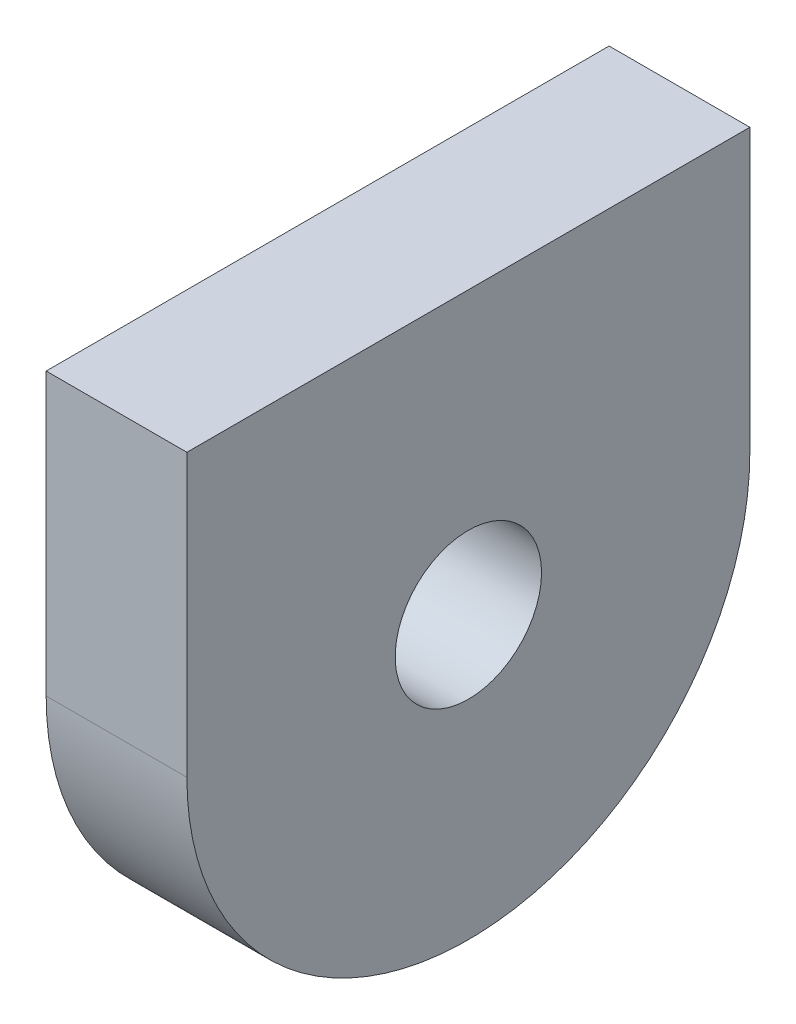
ISO-10303-21;
HEADER;
FILE_DESCRIPTION(('STEP AP214'),'2;1');
FILE_NAME('part.step','',(''),(''),'','','');
FILE_SCHEMA(('AUTOMOTIVE_DESIGN { 1 0 10303 214 1 1 1 1 }'));
ENDSEC;
DATA;
#1=APPLICATION_CONTEXT('core data for automotive mechanical design processes');
#2=APPLICATION_PROTOCOL_DEFINITION('international standard','automotive_design',2000,#1);
#3=PRODUCT_CONTEXT('',#1,'mechanical');
#4=PRODUCT('Part','Part','',(#3));
#5=PRODUCT_RELATED_PRODUCT_CATEGORY('part','',(#4));
#6=PRODUCT_DEFINITION_FORMATION('','',#4);
#7=PRODUCT_DEFINITION_CONTEXT('part definition',#1,'design');
#8=PRODUCT_DEFINITION('design','',#6,#7);
#9=PRODUCT_DEFINITION_SHAPE('','',#8);
#10=(LENGTH_UNIT() NAMED_UNIT(*) SI_UNIT(.MILLI.,.METRE.));
#11=(NAMED_UNIT(*) PLANE_ANGLE_UNIT() SI_UNIT($,.RADIAN.));
#12=(NAMED_UNIT(*) SI_UNIT($,.STERADIAN.) SOLID_ANGLE_UNIT());
#13=UNCERTAINTY_MEASURE_WITH_UNIT(LENGTH_MEASURE(1.E-05),#10,'distance_accuracy_value','');
#14=(GEOMETRIC_REPRESENTATION_CONTEXT(3) GLOBAL_UNCERTAINTY_ASSIGNED_CONTEXT((#13)) GLOBAL_UNIT_ASSIGNED_CONTEXT((#10,
#11,#12)) REPRESENTATION_CONTEXT('',''));
#15=CARTESIAN_POINT('',(0.,0.,0.));
#16=DIRECTION('',(0.,0.,1.));
#17=DIRECTION('',(1.,0.,0.));
#18=AXIS2_PLACEMENT_3D('',#15,#16,#17);
#19=CARTESIAN_POINT('',(-3.175,0.,12.7));
#20=DIRECTION('',(0.,0.,1.));
#21=DIRECTION('',(0.,-1.,0.));
#22=AXIS2_PLACEMENT_3D('',#19,#20,#21);
#23=PLANE('',#22);
#24=DIRECTION('',(1.,0.,0.));
#25=VECTOR('',#24,1.);
#26=CARTESIAN_POINT('',(-3.175,-12.7,12.7));
#27=LINE('',#26,#25);
#28=CARTESIAN_POINT('',(-3.175,-12.7,12.7));
#29=VERTEX_POINT('',#28);
#30=CARTESIAN_POINT('',(3.175,-12.7,12.7));
#31=VERTEX_POINT('',#30);
#32=EDGE_CURVE('E37',#29,#31,#27,.T.);
#33=ORIENTED_EDGE('',*,*,#32,.T.);
#34=DIRECTION('',(0.,-1.,0.));
#35=VECTOR('',#34,1.);
#36=CARTESIAN_POINT('',(3.175,0.,12.7));
#37=LINE('',#36,#35);
#38=CARTESIAN_POINT('',(3.175,0.,12.7));
#39=VERTEX_POINT('',#38);
#40=EDGE_CURVE('E74',#39,#31,#37,.T.);
#41=ORIENTED_EDGE('',*,*,#40,.F.);
#42=DIRECTION('',(1.,0.,0.));
#43=VECTOR('',#42,1.);
#44=CARTESIAN_POINT('',(-3.175,0.,12.7));
#45=LINE('',#44,#43);
#46=CARTESIAN_POINT('',(-3.175,0.,12.7));
#47=VERTEX_POINT('',#46);
#48=EDGE_CURVE('E11',#47,#39,#45,.T.);
#49=ORIENTED_EDGE('',*,*,#48,.F.);
#50=DIRECTION('',(0.,-1.,0.));
#51=VECTOR('',#50,1.);
#52=CARTESIAN_POINT('',(-3.175,0.,12.7));
#53=LINE('',#52,#51);
#54=EDGE_CURVE('E75',#47,#29,#53,.T.);
#55=ORIENTED_EDGE('',*,*,#54,.T.);
#56=EDGE_LOOP('',(#33,#41,#49,#55));
#57=FACE_BOUND('',#56,.T.);
#58=ADVANCED_FACE('F34',(#57),#23,.T.);
#59=CARTESIAN_POINT('',(-3.175,0.,12.7));
#60=DIRECTION('',(0.,1.,0.));
#61=DIRECTION('',(0.,0.,1.));
#62=AXIS2_PLACEMENT_3D('',#59,#60,#61);
#63=PLANE('',#62);
#64=ORIENTED_EDGE('',*,*,#48,.T.);
#65=DIRECTION('',(0.,0.,1.));
#66=VECTOR('',#65,1.);
#67=CARTESIAN_POINT('',(3.175,0.,12.7));
#68=LINE('',#67,#66);
#69=CARTESIAN_POINT('',(3.175,0.,-12.7));
#70=VERTEX_POINT('',#69);
#71=EDGE_CURVE('E92',#70,#39,#68,.T.);
#72=ORIENTED_EDGE('',*,*,#71,.F.);
#73=DIRECTION('',(1.,0.,0.));
#74=VECTOR('',#73,1.);
#75=CARTESIAN_POINT('',(-3.175,0.,-12.7));
#76=LINE('',#75,#74);
#77=CARTESIAN_POINT('',(-3.175,0.,-12.7));
#78=VERTEX_POINT('',#77);
#79=EDGE_CURVE('E42',#78,#70,#76,.T.);
#80=ORIENTED_EDGE('',*,*,#79,.F.);
#81=DIRECTION('',(0.,0.,1.));
#82=VECTOR('',#81,1.);
#83=CARTESIAN_POINT('',(-3.175,0.,12.7));
#84=LINE('',#83,#82);
#85=EDGE_CURVE('E80',#78,#47,#84,.T.);
#86=ORIENTED_EDGE('',*,*,#85,.T.);
#87=EDGE_LOOP('',(#64,#72,#80,#86));
#88=FACE_BOUND('',#87,.T.);
#89=ADVANCED_FACE('F113',(#88),#63,.T.);
#90=CARTESIAN_POINT('',(-3.175,0.,-12.7));
#91=DIRECTION('',(0.,0.,-1.));
#92=DIRECTION('',(0.,1.,0.));
#93=AXIS2_PLACEMENT_3D('',#90,#91,#92);
#94=PLANE('',#93);
#95=ORIENTED_EDGE('',*,*,#79,.T.);
#96=DIRECTION('',(0.,1.,0.));
#97=VECTOR('',#96,1.);
#98=CARTESIAN_POINT('',(3.175,0.,-12.7));
#99=LINE('',#98,#97);
#100=CARTESIAN_POINT('',(3.175,-12.7,-12.7));
#101=VERTEX_POINT('',#100);
#102=EDGE_CURVE('E87',#101,#70,#99,.T.);
#103=ORIENTED_EDGE('',*,*,#102,.F.);
#104=DIRECTION('',(1.,0.,0.));
#105=VECTOR('',#104,1.);
#106=CARTESIAN_POINT('',(-3.175,-12.7,-12.7));
#107=LINE('',#106,#105);
#108=CARTESIAN_POINT('',(-3.175,-12.7,-12.7));
#109=VERTEX_POINT('',#108);
#110=EDGE_CURVE('E79',#109,#101,#107,.T.);
#111=ORIENTED_EDGE('',*,*,#110,.F.);
#112=DIRECTION('',(0.,1.,0.));
#113=VECTOR('',#112,1.);
#114=CARTESIAN_POINT('',(-3.175,0.,-12.7));
#115=LINE('',#114,#113);
#116=EDGE_CURVE('E106',#109,#78,#115,.T.);
#117=ORIENTED_EDGE('',*,*,#116,.T.);
#118=EDGE_LOOP('',(#95,#103,#111,#117));
#119=FACE_BOUND('',#118,.T.);
#120=ADVANCED_FACE('F110',(#119),#94,.T.);
#121=CARTESIAN_POINT('',(-3.175,-12.7,0.));
#122=DIRECTION('',(1.,0.,0.));
#123=DIRECTION('',(0.,0.,-1.));
#124=AXIS2_PLACEMENT_3D('',#121,#122,#123);
#125=CYLINDRICAL_SURFACE('',#124,12.7);
#126=ORIENTED_EDGE('',*,*,#110,.T.);
#127=CARTESIAN_POINT('',(3.175,-12.7,0.));
#128=DIRECTION('',(1.,0.,0.));
#129=DIRECTION('',(0.,0.,-1.));
#130=AXIS2_PLACEMENT_3D('',#127,#128,#129);
#131=CIRCLE('',#130,12.7);
#132=EDGE_CURVE('E82',#31,#101,#131,.T.);
#133=ORIENTED_EDGE('',*,*,#132,.F.);
#134=ORIENTED_EDGE('',*,*,#32,.F.);
#135=CARTESIAN_POINT('',(-3.175,-12.7,0.));
#136=DIRECTION('',(1.,0.,0.));
#137=DIRECTION('',(0.,0.,-1.));
#138=AXIS2_PLACEMENT_3D('',#135,#136,#137);
#139=CIRCLE('',#138,12.7);
#140=EDGE_CURVE('E104',#29,#109,#139,.T.);
#141=ORIENTED_EDGE('',*,*,#140,.T.);
#142=EDGE_LOOP('',(#126,#133,#134,#141));
#143=FACE_BOUND('',#142,.T.);
#144=ADVANCED_FACE('F83',(#143),#125,.T.);
#145=CARTESIAN_POINT('',(-3.175,-12.7,0.));
#146=DIRECTION('',(1.,0.,0.));
#147=DIRECTION('',(0.,0.,-1.));
#148=AXIS2_PLACEMENT_3D('',#145,#146,#147);
#149=PLANE('',#148);
#150=CARTESIAN_POINT('',(-3.175,-12.7,0.));
#151=DIRECTION('',(1.,0.,0.));
#152=DIRECTION('',(0.,0.,-1.));
#153=AXIS2_PLACEMENT_3D('',#150,#151,#152);
#154=CIRCLE('',#153,3.302);
#155=CARTESIAN_POINT('',(-3.175,-12.7,-3.302));
#156=VERTEX_POINT('',#155);
#157=EDGE_CURVE('E100',#156,#156,#154,.T.);
#158=ORIENTED_EDGE('',*,*,#157,.T.);
#159=EDGE_LOOP('',(#158));
#160=FACE_BOUND('',#159,.T.);
#161=ORIENTED_EDGE('',*,*,#54,.F.);
#162=ORIENTED_EDGE('',*,*,#85,.F.);
#163=ORIENTED_EDGE('',*,*,#116,.F.);
#164=ORIENTED_EDGE('',*,*,#140,.F.);
#165=EDGE_LOOP('',(#161,#162,#163,#164));
#166=FACE_BOUND('',#165,.T.);
#167=ADVANCED_FACE('F115',(#160,#166),#149,.F.);
#168=CARTESIAN_POINT('',(-3.175,-12.7,0.));
#169=DIRECTION('',(1.,0.,0.));
#170=DIRECTION('',(0.,0.,-1.));
#171=AXIS2_PLACEMENT_3D('',#168,#169,#170);
#172=CYLINDRICAL_SURFACE('',#171,3.302);
#173=ORIENTED_EDGE('',*,*,#157,.F.);
#174=EDGE_LOOP('',(#173));
#175=FACE_BOUND('',#174,.T.);
#176=CARTESIAN_POINT('',(3.175,-12.7,0.));
#177=DIRECTION('',(1.,0.,0.));
#178=DIRECTION('',(0.,0.,-1.));
#179=AXIS2_PLACEMENT_3D('',#176,#177,#178);
#180=CIRCLE('',#179,3.302);
#181=CARTESIAN_POINT('',(3.175,-12.7,-3.302));
#182=VERTEX_POINT('',#181);
#183=EDGE_CURVE('E93',#182,#182,#180,.T.);
#184=ORIENTED_EDGE('',*,*,#183,.T.);
#185=EDGE_LOOP('',(#184));
#186=FACE_BOUND('',#185,.T.);
#187=ADVANCED_FACE('F117',(#175,#186),#172,.F.);
#188=CARTESIAN_POINT('',(3.175,-12.7,0.));
#189=DIRECTION('',(1.,0.,0.));
#190=DIRECTION('',(0.,0.,-1.));
#191=AXIS2_PLACEMENT_3D('',#188,#189,#190);
#192=PLANE('',#191);
#193=ORIENTED_EDGE('',*,*,#40,.T.);
#194=ORIENTED_EDGE('',*,*,#132,.T.);
#195=ORIENTED_EDGE('',*,*,#102,.T.);
#196=ORIENTED_EDGE('',*,*,#71,.T.);
#197=EDGE_LOOP('',(#193,#194,#195,#196));
#198=FACE_BOUND('',#197,.T.);
#199=ORIENTED_EDGE('',*,*,#183,.F.);
#200=EDGE_LOOP('',(#199));
#201=FACE_BOUND('',#200,.T.);
#202=ADVANCED_FACE('F90',(#198,#201),#192,.T.);
#203=CLOSED_SHELL('',(#58,#89,#120,#144,#167,#187,#202));
#204=MANIFOLD_SOLID_BREP('B2',#203);
#205=ADVANCED_BREP_SHAPE_REPRESENTATION('',(#18,#204),#14);
#206=SHAPE_DEFINITION_REPRESENTATION(#9,#205);
ENDSEC;
END-ISO-10303-21;
